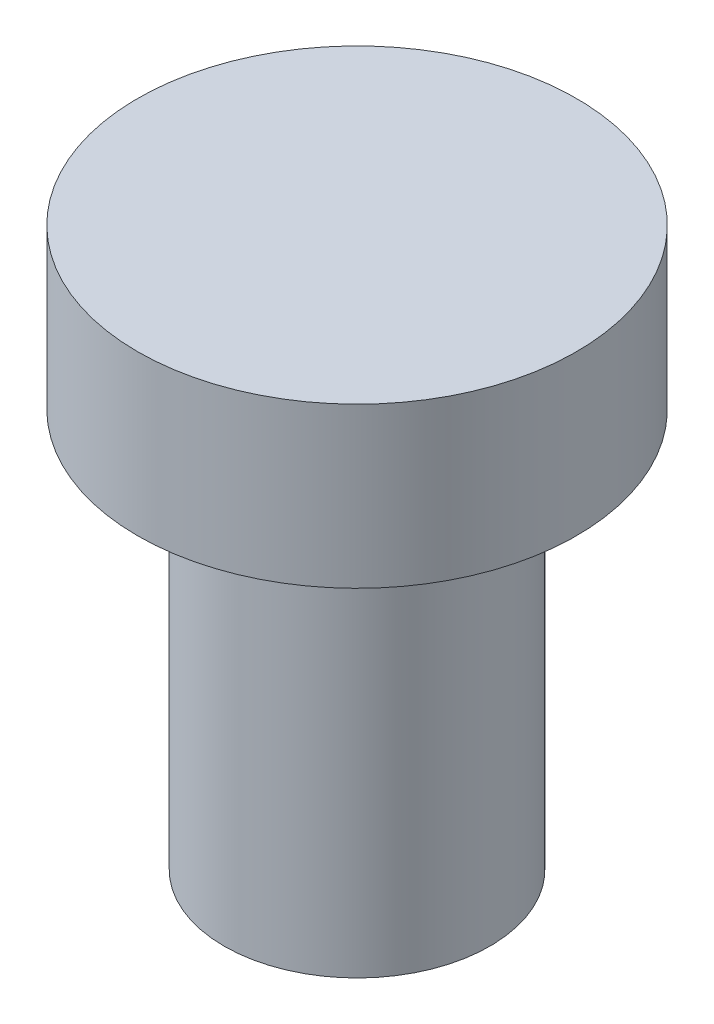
ISO-10303-21;
HEADER;
FILE_DESCRIPTION(('STEP AP214'),'2;1');
FILE_NAME('part.step','',(''),(''),'','','');
FILE_SCHEMA(('AUTOMOTIVE_DESIGN { 1 0 10303 214 1 1 1 1 }'));
ENDSEC;
DATA;
#1=APPLICATION_CONTEXT('core data for automotive mechanical design processes');
#2=APPLICATION_PROTOCOL_DEFINITION('international standard','automotive_design',2000,#1);
#3=PRODUCT_CONTEXT('',#1,'mechanical');
#4=PRODUCT('Part','Part','',(#3));
#5=PRODUCT_RELATED_PRODUCT_CATEGORY('part','',(#4));
#6=PRODUCT_DEFINITION_FORMATION('','',#4);
#7=PRODUCT_DEFINITION_CONTEXT('part definition',#1,'design');
#8=PRODUCT_DEFINITION('design','',#6,#7);
#9=PRODUCT_DEFINITION_SHAPE('','',#8);
#10=(LENGTH_UNIT() NAMED_UNIT(*) SI_UNIT(.MILLI.,.METRE.));
#11=(NAMED_UNIT(*) PLANE_ANGLE_UNIT() SI_UNIT($,.RADIAN.));
#12=(NAMED_UNIT(*) SI_UNIT($,.STERADIAN.) SOLID_ANGLE_UNIT());
#13=UNCERTAINTY_MEASURE_WITH_UNIT(LENGTH_MEASURE(1.E-05),#10,'distance_accuracy_value','');
#14=(GEOMETRIC_REPRESENTATION_CONTEXT(3) GLOBAL_UNCERTAINTY_ASSIGNED_CONTEXT((#13)) GLOBAL_UNIT_ASSIGNED_CONTEXT((#10,
#11,#12)) REPRESENTATION_CONTEXT('',''));
#15=CARTESIAN_POINT('',(0.,0.,0.));
#16=DIRECTION('',(0.,0.,1.));
#17=DIRECTION('',(1.,0.,0.));
#18=AXIS2_PLACEMENT_3D('',#15,#16,#17);
#19=CARTESIAN_POINT('',(0.,15.,0.));
#20=DIRECTION('',(0.,-1.,0.));
#21=DIRECTION('',(0.,0.,-1.));
#22=AXIS2_PLACEMENT_3D('',#19,#20,#21);
#23=CYLINDRICAL_SURFACE('',#22,5.);
#24=CARTESIAN_POINT('',(0.,15.,0.));
#25=DIRECTION('',(0.,1.,0.));
#26=DIRECTION('',(0.,0.,1.));
#27=AXIS2_PLACEMENT_3D('',#24,#25,#26);
#28=CIRCLE('',#27,5.);
#29=CARTESIAN_POINT('',(0.,15.,5.));
#30=VERTEX_POINT('',#29);
#31=EDGE_CURVE('E10',#30,#30,#28,.T.);
#32=ORIENTED_EDGE('',*,*,#31,.F.);
#33=EDGE_LOOP('',(#32));
#34=FACE_BOUND('',#33,.T.);
#35=CARTESIAN_POINT('',(0.,0.,0.));
#36=DIRECTION('',(0.,1.,0.));
#37=DIRECTION('',(0.,0.,1.));
#38=AXIS2_PLACEMENT_3D('',#35,#36,#37);
#39=CIRCLE('',#38,5.);
#40=CARTESIAN_POINT('',(0.,0.,5.));
#41=VERTEX_POINT('',#40);
#42=EDGE_CURVE('E33',#41,#41,#39,.T.);
#43=ORIENTED_EDGE('',*,*,#42,.T.);
#44=EDGE_LOOP('',(#43));
#45=FACE_BOUND('',#44,.T.);
#46=ADVANCED_FACE('F30',(#34,#45),#23,.T.);
#47=CARTESIAN_POINT('',(0.,0.,0.));
#48=DIRECTION('',(0.,1.,0.));
#49=DIRECTION('',(0.,0.,1.));
#50=AXIS2_PLACEMENT_3D('',#47,#48,#49);
#51=PLANE('',#50);
#52=ORIENTED_EDGE('',*,*,#42,.F.);
#53=EDGE_LOOP('',(#52));
#54=FACE_BOUND('',#53,.T.);
#55=ADVANCED_FACE('F58',(#54),#51,.F.);
#56=CARTESIAN_POINT('',(0.,15.,0.));
#57=DIRECTION('',(0.,1.,0.));
#58=DIRECTION('',(0.,0.,1.));
#59=AXIS2_PLACEMENT_3D('',#56,#57,#58);
#60=PLANE('',#59);
#61=CARTESIAN_POINT('',(0.,15.,0.));
#62=DIRECTION('',(0.,1.,0.));
#63=DIRECTION('',(0.,0.,1.));
#64=AXIS2_PLACEMENT_3D('',#61,#62,#63);
#65=CIRCLE('',#64,8.25544444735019);
#66=CARTESIAN_POINT('',(0.,15.,8.25544444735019));
#67=VERTEX_POINT('',#66);
#68=EDGE_CURVE('E42',#67,#67,#65,.T.);
#69=ORIENTED_EDGE('',*,*,#68,.F.);
#70=EDGE_LOOP('',(#69));
#71=FACE_BOUND('',#70,.T.);
#72=ORIENTED_EDGE('',*,*,#31,.T.);
#73=EDGE_LOOP('',(#72));
#74=FACE_BOUND('',#73,.T.);
#75=ADVANCED_FACE('F53',(#71,#74),#60,.F.);
#76=CARTESIAN_POINT('',(0.,21.,0.));
#77=DIRECTION('',(0.,-1.,0.));
#78=DIRECTION('',(0.,0.,-1.));
#79=AXIS2_PLACEMENT_3D('',#76,#77,#78);
#80=CYLINDRICAL_SURFACE('',#79,8.25544444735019);
#81=CARTESIAN_POINT('',(0.,21.,0.));
#82=DIRECTION('',(0.,1.,0.));
#83=DIRECTION('',(0.,0.,1.));
#84=AXIS2_PLACEMENT_3D('',#81,#82,#83);
#85=CIRCLE('',#84,8.25544444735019);
#86=CARTESIAN_POINT('',(0.,21.,8.25544444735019));
#87=VERTEX_POINT('',#86);
#88=EDGE_CURVE('E40',#87,#87,#85,.T.);
#89=ORIENTED_EDGE('',*,*,#88,.F.);
#90=EDGE_LOOP('',(#89));
#91=FACE_BOUND('',#90,.T.);
#92=ORIENTED_EDGE('',*,*,#68,.T.);
#93=EDGE_LOOP('',(#92));
#94=FACE_BOUND('',#93,.T.);
#95=ADVANCED_FACE('F50',(#91,#94),#80,.T.);
#96=CARTESIAN_POINT('',(0.,21.,0.));
#97=DIRECTION('',(0.,1.,0.));
#98=DIRECTION('',(0.,0.,1.));
#99=AXIS2_PLACEMENT_3D('',#96,#97,#98);
#100=PLANE('',#99);
#101=ORIENTED_EDGE('',*,*,#88,.T.);
#102=EDGE_LOOP('',(#101));
#103=FACE_BOUND('',#102,.T.);
#104=ADVANCED_FACE('F48',(#103),#100,.T.);
#105=CLOSED_SHELL('',(#46,#55,#75,#95,#104));
#106=MANIFOLD_SOLID_BREP('B2',#105);
#107=ADVANCED_BREP_SHAPE_REPRESENTATION('',(#18,#106),#14);
#108=SHAPE_DEFINITION_REPRESENTATION(#9,#107);
ENDSEC;
END-ISO-10303-21;
